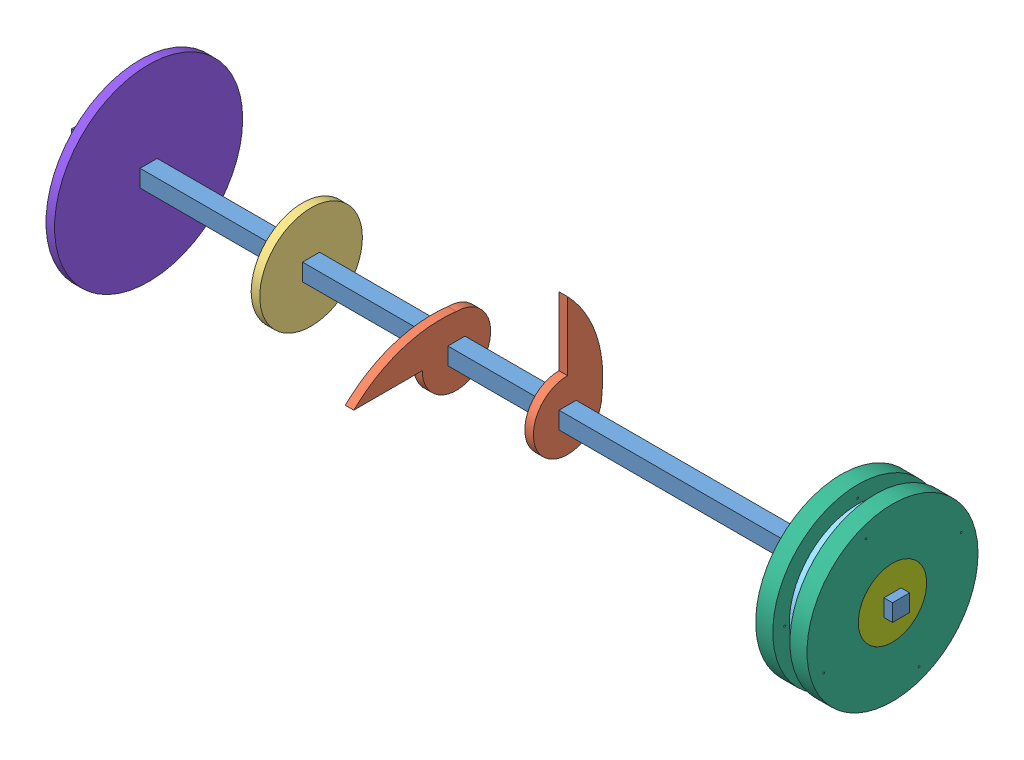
SolidWorks assembly main_drive_shaft.SLDASM, configuration Default (file format 4700). Lengths in mm.
Overall size (304.8 83.13 83.13).
15 component instances, 8 part files, 15 mates.
Components (placement in the parent):
- drive_shaft-1: drive_shaft.SLDPRT [Default] at (-80.7304 11.955 34.4783) size (304.8 6.35 6.35)
- snail_cam-1: snail_cam.SLDPRT [Default] at (38.7664 21.4735 9.8122) x (0 0 -1) z (1 0 0) size (25.76 50.8 3.17)
- snail_cam-2: snail_cam.SLDPRT [Default] at (-2.5086 56.463 30.5048) x (0 1 0) z (1 0 0) size (25.76 50.8 3.17)
- drive_lathe-1: drive_lathe.SLDPRT [Default] at (-53.3086 0.8586 77.3593) x (0 0 1) z (-1 0 0) size (38.1 38.1 3.17)
- MusicBoxCrank_assem_final-1: MusicBoxCrank_assem_final.SLDASM [Default] at (154.4822 33.5294 39.3811) x (0 1 0) z (-1 0 0) size (83.13 83.13 19.05)
  - catchpeg_musicboxcrank-5: catchpeg_musicboxcrank.SLDPRT [Default] at (-4.9075 1.7278 -1.7592) size (10.84 6.03 6.35)
  - Outer_ring_musicboxcrank-1: Outer_ring_musicboxcrank.SLDPRT [Default] at (-4.854 1.5337 -1.7592) size (50.8 50.8 6.35)
  - catchpeg_musicboxcrank-2: catchpeg_musicboxcrank.SLDPRT [Default] at (-5.2855 3.0995 -1.7592) x (-0.5 0.866025 0) z (0 0 1) size (10.84 6.03 6.35)
  - catchpeg_musicboxcrank-3: catchpeg_musicboxcrank.SLDPRT [Default] at (-5.9284 0.6924 -1.7592) x (-0.5 -0.866025 0) z (0 0 1) size (10.84 6.03 6.35)
  - catchpeg_musicboxcrank-4: catchpeg_musicboxcrank.SLDPRT [Default] at (-3.5674 1.3789 -1.7592) size (10.84 6.03 6.35)
  - plate-1: plate.SLDPRT [Default] at (3.3361 -1.7577 4.5908) x (0.999302 -0.037368 0) z (0 0 1) size (63.5 63.5 6.35)
  - plate-2: plate.SLDPRT [Default] at (1.5791 -4.4389 -8.1092) x (0.922037 -0.387101 0) z (0 0 1) size (63.5 63.5 6.35)
  - plateinner-1: plateinner.SLDPRT [Default] at (-4.9075 1.7278 -8.1092) size (25.4 25.4 6.35)
  - plateinner-2: plateinner.SLDPRT [Default] at (-4.9075 1.7278 4.5908) size (25.4 25.4 6.35)
- drive_shaft_gear_placeholder-1: drive_shaft_gear_placeholder.SLDPRT [Default] at (-113.6336 2.1771 88.5217) x (0 0 1) z (-1 0 0) size (69.85 69.85 3.17)
Mates (geometry in assembly coordinates):
- Coincident1: coincident anti-aligned: plane of drive_shaft-1 through (-139.0336 25.4469 40.8283) normal (0 0 1); plane of snail_cam-1 through (41.9414 25.4469 40.8283) normal (0 0 -1)
- Coincident2: coincident anti-aligned: plane of drive_shaft-1 through (-139.0336 25.4469 40.8283) normal (0 -1 0); plane of snail_cam-1 through (41.9414 25.4469 40.8283) normal (0 1 0)
- Coincident3: coincident anti-aligned: plane of drive_shaft-1 through (-139.0336 31.7969 40.8283) normal (0 1 0); plane of snail_cam-2 through (0.6664 31.7969 34.4783) normal (0 -1 0)
- Coincident4: coincident anti-aligned: plane of drive_shaft-1 through (-139.0336 25.4469 40.8283) normal (0 0 1); plane of snail_cam-2 through (0.6664 25.4469 40.8283) normal (0 0 -1)
- Distance1: distance = 136.525 mm aligned: plane of snail_cam-2 through (-2.5086 28.6219 37.6533) normal (-1 0 0); plane of drive_shaft-1 through (-139.0336 31.7969 40.8283) normal (-1 0 0)
- Distance2: distance = 38.1 mm anti-aligned: plane of snail_cam-2 through (0.6664 28.6219 37.6533) normal (1 0 0); plane of snail_cam-1 through (38.7664 28.6219 37.6533) normal (-1 0 0)
- Coincident9: coincident anti-aligned: plane of drive_shaft-1 through (-139.0336 31.7969 40.8283) normal (0 1 0); plane of drive_lathe-1 through (-56.4836 31.7969 34.4783) normal (0 -1 0)
- Coincident10: coincident anti-aligned: plane of drive_shaft-1 through (-139.0336 25.4469 40.8283) normal (0 0 1); plane of drive_lathe-1 through (-56.4836 25.4469 40.8283) normal (0 0 -1)
- Distance3: distance = 50.8 mm anti-aligned: plane of snail_cam-2 through (-2.5086 28.6219 37.6533) normal (-1 0 0); plane of drive_lathe-1 through (-53.3086 28.6219 37.6533) normal (1 0 0)
- Coincident11: coincident anti-aligned: plane of drive_shaft-1 through (-139.0336 25.4469 40.8283) normal (0 0 1); plane of MusicBoxCrank_assem_final-1/plateinner-2 through (143.5414 25.4469 40.8283) normal (0 0 -1)
- Coincident12: coincident anti-aligned: plane of drive_shaft-1 through (-139.0336 31.7969 40.8283) normal (0 1 0); plane of MusicBoxCrank_assem_final-1/plateinner-2 through (143.5414 31.7969 34.4783) normal (0 -1 0)
- Distance4: distance = 3.175 mm aligned: plane of MusicBoxCrank_assem_final-1/plateinner-1 through (162.5914 28.6219 37.6533) normal (1 0 0); plane of drive_shaft-1 through (165.7664 31.7969 40.8283) normal (1 0 0)
- Coincident13: coincident anti-aligned: plane of drive_shaft-1 through (-139.0336 25.4469 40.8283) normal (0 0 1); plane of drive_shaft_gear_placeholder-1 through (-116.8086 25.4469 40.8283) normal (0 0 -1)
- Coincident14: coincident anti-aligned: plane of drive_shaft-1 through (-139.0336 25.4469 40.8283) normal (0 -1 0); plane of drive_shaft_gear_placeholder-1 through (-116.8086 25.4469 34.4783) normal (0 1 0)
- Distance5: distance = 22.225 mm aligned: plane of drive_shaft-1 through (-139.0336 31.7969 40.8283) normal (-1 0 0); plane of drive_shaft_gear_placeholder-1 through (-116.8086 28.6219 37.6533) normal (-1 0 0)
